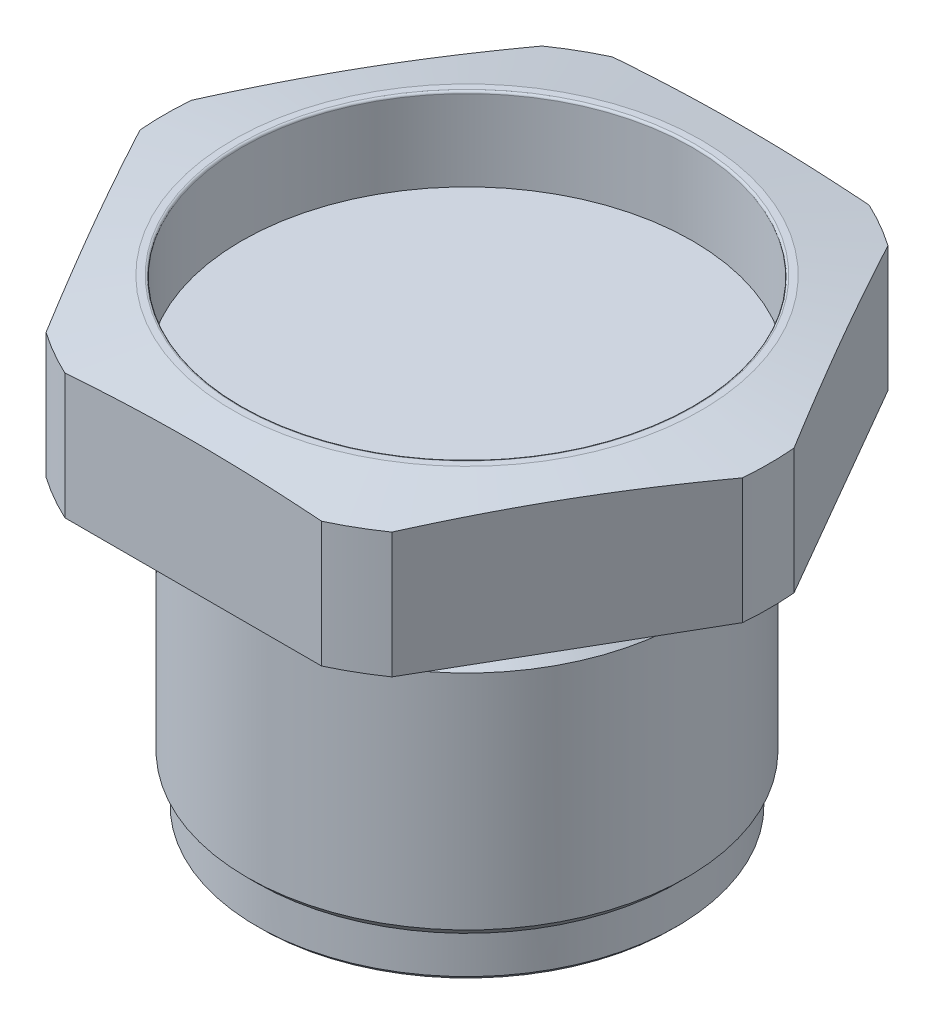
ISO-10303-21;
HEADER;
FILE_DESCRIPTION(('STEP AP214'),'2;1');
FILE_NAME('part.step','',(''),(''),'','','');
FILE_SCHEMA(('AUTOMOTIVE_DESIGN { 1 0 10303 214 1 1 1 1 }'));
ENDSEC;
DATA;
#1=APPLICATION_CONTEXT('core data for automotive mechanical design processes');
#2=APPLICATION_PROTOCOL_DEFINITION('international standard','automotive_design',2000,#1);
#3=PRODUCT_CONTEXT('',#1,'mechanical');
#4=PRODUCT('Part','Part','',(#3));
#5=PRODUCT_RELATED_PRODUCT_CATEGORY('part','',(#4));
#6=PRODUCT_DEFINITION_FORMATION('','',#4);
#7=PRODUCT_DEFINITION_CONTEXT('part definition',#1,'design');
#8=PRODUCT_DEFINITION('design','',#6,#7);
#9=PRODUCT_DEFINITION_SHAPE('','',#8);
#10=(LENGTH_UNIT() NAMED_UNIT(*) SI_UNIT(.MILLI.,.METRE.));
#11=(NAMED_UNIT(*) PLANE_ANGLE_UNIT() SI_UNIT($,.RADIAN.));
#12=(NAMED_UNIT(*) SI_UNIT($,.STERADIAN.) SOLID_ANGLE_UNIT());
#13=UNCERTAINTY_MEASURE_WITH_UNIT(LENGTH_MEASURE(1.E-05),#10,'distance_accuracy_value','');
#14=(GEOMETRIC_REPRESENTATION_CONTEXT(3) GLOBAL_UNCERTAINTY_ASSIGNED_CONTEXT((#13)) GLOBAL_UNIT_ASSIGNED_CONTEXT((#10,
#11,#12)) REPRESENTATION_CONTEXT('',''));
#15=CARTESIAN_POINT('',(0.,0.,0.));
#16=DIRECTION('',(0.,0.,1.));
#17=DIRECTION('',(1.,0.,0.));
#18=AXIS2_PLACEMENT_3D('',#15,#16,#17);
#19=CARTESIAN_POINT('',(24.257,-37.6428,0.));
#20=DIRECTION('',(0.,-1.,0.));
#21=DIRECTION('',(0.,0.,-1.));
#22=AXIS2_PLACEMENT_3D('',#19,#20,#21);
#23=PLANE('',#22);
#24=CARTESIAN_POINT('',(0.,-37.6428,0.));
#25=DIRECTION('',(0.,-1.,0.));
#26=DIRECTION('',(0.,0.,-1.));
#27=AXIS2_PLACEMENT_3D('',#24,#25,#26);
#28=CIRCLE('',#27,22.1334044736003);
#29=CARTESIAN_POINT('',(0.,-37.6428,-22.1334044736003));
#30=VERTEX_POINT('',#29);
#31=EDGE_CURVE('E12',#30,#30,#28,.T.);
#32=ORIENTED_EDGE('',*,*,#31,.F.);
#33=EDGE_LOOP('',(#32));
#34=FACE_BOUND('',#33,.T.);
#35=CARTESIAN_POINT('',(0.,-37.6428,0.));
#36=DIRECTION('',(0.,-1.,0.));
#37=DIRECTION('',(0.,0.,-1.));
#38=AXIS2_PLACEMENT_3D('',#35,#36,#37);
#39=CIRCLE('',#38,23.75700224);
#40=CARTESIAN_POINT('',(0.,-37.6428,-23.75700224));
#41=VERTEX_POINT('',#40);
#42=EDGE_CURVE('E184',#41,#41,#39,.T.);
#43=ORIENTED_EDGE('',*,*,#42,.T.);
#44=EDGE_LOOP('',(#43));
#45=FACE_BOUND('',#44,.T.);
#46=ADVANCED_FACE('F35',(#34,#45),#23,.T.);
#47=CARTESIAN_POINT('',(0.,-8.96894233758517,0.));
#48=DIRECTION('',(0.,-1.,0.));
#49=DIRECTION('',(0.,0.,-1.));
#50=AXIS2_PLACEMENT_3D('',#47,#48,#49);
#51=CYLINDRICAL_SURFACE('',#50,24.257);
#52=CARTESIAN_POINT('',(0.,-0.508,0.));
#53=DIRECTION('',(0.,-1.,0.));
#54=DIRECTION('',(0.,0.,-1.));
#55=AXIS2_PLACEMENT_3D('',#52,#53,#54);
#56=CIRCLE('',#55,24.257);
#57=CARTESIAN_POINT('',(0.,-0.508,-24.257));
#58=VERTEX_POINT('',#57);
#59=EDGE_CURVE('E201',#58,#58,#56,.T.);
#60=ORIENTED_EDGE('',*,*,#59,.T.);
#61=EDGE_LOOP('',(#60));
#62=FACE_BOUND('',#61,.T.);
#63=CARTESIAN_POINT('',(0.,-4.826,0.));
#64=DIRECTION('',(0.,-1.,0.));
#65=DIRECTION('',(0.,0.,-1.));
#66=AXIS2_PLACEMENT_3D('',#63,#64,#65);
#67=CIRCLE('',#66,24.257);
#68=CARTESIAN_POINT('',(0.,-4.826,-24.257));
#69=VERTEX_POINT('',#68);
#70=EDGE_CURVE('E198',#69,#69,#67,.T.);
#71=ORIENTED_EDGE('',*,*,#70,.F.);
#72=EDGE_LOOP('',(#71));
#73=FACE_BOUND('',#72,.T.);
#74=ADVANCED_FACE('F213',(#62,#73),#51,.T.);
#75=CARTESIAN_POINT('',(0.,14.4866013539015,0.));
#76=DIRECTION('',(0.,-1.,0.));
#77=DIRECTION('',(0.,0.,-1.));
#78=AXIS2_PLACEMENT_3D('',#75,#76,#77);
#79=CONICAL_SURFACE('',#78,34.925,1.39626340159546);
#80=CARTESIAN_POINT('',(0.,15.875,0.));
#81=DIRECTION('',(0.,-1.,0.));
#82=DIRECTION('',(0.,0.,-1.));
#83=AXIS2_PLACEMENT_3D('',#80,#81,#82);
#84=CIRCLE('',#83,27.051);
#85=CARTESIAN_POINT('',(0.,15.875,-27.051));
#86=VERTEX_POINT('',#85);
#87=EDGE_CURVE('E160',#86,#86,#84,.T.);
#88=ORIENTED_EDGE('',*,*,#87,.T.);
#89=EDGE_LOOP('',(#88));
#90=FACE_BOUND('',#89,.T.);
#91=CARTESIAN_POINT('',(0.,14.4866013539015,0.));
#92=DIRECTION('',(0.,-1.,0.));
#93=DIRECTION('',(0.,0.,-1.));
#94=AXIS2_PLACEMENT_3D('',#91,#92,#93);
#95=CIRCLE('',#94,34.925);
#96=CARTESIAN_POINT('',(-34.798161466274,14.4866013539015,2.97381633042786));
#97=VERTEX_POINT('',#96);
#98=CARTESIAN_POINT('',(-34.7981614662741,14.4866013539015,-2.97381633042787));
#99=VERTEX_POINT('',#98);
#100=EDGE_CURVE('E372',#97,#99,#95,.T.);
#101=ORIENTED_EDGE('',*,*,#100,.F.);
#102=CARTESIAN_POINT('',(-34.7994975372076,14.4864013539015,2.97150218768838));
#103=CARTESIAN_POINT('',(-34.490945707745,14.5325933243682,3.50592963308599));
#104=CARTESIAN_POINT('',(-34.1823063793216,14.5764325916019,4.04050863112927));
#105=CARTESIAN_POINT('',(-33.5648562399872,14.6590851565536,5.1099636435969));
#106=CARTESIAN_POINT('',(-33.2560454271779,14.6978983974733,5.64483966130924));
#107=CARTESIAN_POINT('',(-32.3293298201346,14.8063216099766,7.24995817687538));
#108=CARTESIAN_POINT('',(-31.7111834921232,14.8679087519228,8.32061902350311));
#109=CARTESIAN_POINT('',(-30.4753697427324,14.9673711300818,10.4611112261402));
#110=CARTESIAN_POINT('',(-29.8577030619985,15.0052829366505,11.5309412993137));
#111=CARTESIAN_POINT('',(-28.6221313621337,15.056013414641,13.6710142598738));
#112=CARTESIAN_POINT('',(-28.0042263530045,15.0688330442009,14.7412571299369));
#113=CARTESIAN_POINT('',(-26.7684163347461,15.0688330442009,16.8817428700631));
#114=CARTESIAN_POINT('',(-26.1505113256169,15.056013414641,17.9519857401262));
#115=CARTESIAN_POINT('',(-24.9149396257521,15.0052829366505,20.0920587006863));
#116=CARTESIAN_POINT('',(-24.2972729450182,14.9673711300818,21.1618887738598));
#117=CARTESIAN_POINT('',(-23.0614591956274,14.8679087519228,23.3023809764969));
#118=CARTESIAN_POINT('',(-22.4433128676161,14.8063216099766,24.3730418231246));
#119=CARTESIAN_POINT('',(-21.5165972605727,14.6978983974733,25.9781603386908));
#120=CARTESIAN_POINT('',(-21.2077864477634,14.6590851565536,26.5130363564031));
#121=CARTESIAN_POINT('',(-20.590336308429,14.5764325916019,27.5824913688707));
#122=CARTESIAN_POINT('',(-20.2816969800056,14.5325933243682,28.117070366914));
#123=CARTESIAN_POINT('',(-19.973145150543,14.4864013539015,28.6514978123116));
#124=B_SPLINE_CURVE_WITH_KNOTS('',3,(#102,#103,#104,#105,#106,#107,#108,#109,#110,#111,#112,
#113,#114,#115,#116,#117,#118,#119,#120,#121,#122,#123),.UNSPECIFIED.,.F.,.F.,(4,2,2,2,2,2,2,2,
2,2,4),(0.,1.85648195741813,3.71298489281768,7.42624125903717,11.1337476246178,14.8411124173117,
18.5484772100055,22.2559835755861,25.9692399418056,27.8257428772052,29.6822248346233),.UNSPECIFIED.);
#125=CARTESIAN_POINT('',(-19.9744812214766,14.4866013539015,28.6491836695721));
#126=VERTEX_POINT('',#125);
#127=EDGE_CURVE('E333',#97,#126,#124,.T.);
#128=ORIENTED_EDGE('',*,*,#127,.T.);
#129=CARTESIAN_POINT('',(-14.8236802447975,14.4866013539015,31.623));
#130=VERTEX_POINT('',#129);
#131=EDGE_CURVE('E178',#130,#126,#95,.T.);
#132=ORIENTED_EDGE('',*,*,#131,.F.);
#133=CARTESIAN_POINT('',(-48.1567000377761,10.4863639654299,31.623));
#134=CARTESIAN_POINT('',(-47.4393926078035,10.5920854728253,31.623));
#135=CARTESIAN_POINT('',(-46.7219832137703,10.6971147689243,31.623));
#136=CARTESIAN_POINT('',(-45.2869404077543,10.9056390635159,31.623));
#137=CARTESIAN_POINT('',(-44.569306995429,11.0091340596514,31.623));
#138=CARTESIAN_POINT('',(-42.4160180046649,11.3170960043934,31.623));
#139=CARTESIAN_POINT('',(-40.9799995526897,11.5190360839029,31.623));
#140=CARTESIAN_POINT('',(-38.1062127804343,11.9147802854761,31.623));
#141=CARTESIAN_POINT('',(-36.6684439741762,12.1085808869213,31.623));
#142=CARTESIAN_POINT('',(-33.7915811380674,12.4860790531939,31.623));
#143=CARTESIAN_POINT('',(-32.3524871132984,12.6697766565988,31.623));
#144=CARTESIAN_POINT('',(-29.4776046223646,13.0241287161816,31.623));
#145=CARTESIAN_POINT('',(-28.0418213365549,13.1948249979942,31.623));
#146=CARTESIAN_POINT('',(-25.168512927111,13.5209937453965,31.623));
#147=CARTESIAN_POINT('',(-23.7309878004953,13.6764661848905,31.623));
#148=CARTESIAN_POINT('',(-20.8541177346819,13.968739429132,31.623));
#149=CARTESIAN_POINT('',(-19.4147729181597,14.1055414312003,31.623));
#150=CARTESIAN_POINT('',(-16.5340924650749,14.3565373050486,31.623));
#151=CARTESIAN_POINT('',(-15.0927568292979,14.4707311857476,31.623));
#152=CARTESIAN_POINT('',(-12.2014034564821,14.6727749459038,31.623));
#153=CARTESIAN_POINT('',(-10.7513767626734,14.760498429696,31.623));
#154=CARTESIAN_POINT('',(-7.84976297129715,14.904850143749,31.623));
#155=CARTESIAN_POINT('',(-6.39817588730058,14.9614786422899,31.623));
#156=CARTESIAN_POINT('',(-3.49431685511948,15.0405951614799,31.623));
#157=CARTESIAN_POINT('',(-2.04204507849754,15.0630893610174,31.623));
#158=CARTESIAN_POINT('',(0.862616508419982,15.0726378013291,31.623));
#159=CARTESIAN_POINT('',(2.31500631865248,15.0596920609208,31.623));
#160=CARTESIAN_POINT('',(5.22133074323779,14.9990802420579,31.623));
#161=CARTESIAN_POINT('',(6.67526419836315,14.9513596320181,31.623));
#162=CARTESIAN_POINT('',(9.58170754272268,14.8237856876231,31.623));
#163=CARTESIAN_POINT('',(11.0342174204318,14.7439320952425,31.623));
#164=CARTESIAN_POINT('',(13.9377497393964,14.5559219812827,31.623));
#165=CARTESIAN_POINT('',(15.3887717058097,14.4477582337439,31.623));
#166=CARTESIAN_POINT('',(18.2888053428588,14.2074244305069,31.623));
#167=CARTESIAN_POINT('',(19.7378170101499,14.0752543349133,31.623));
#168=CARTESIAN_POINT('',(22.5560206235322,13.7986726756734,31.623));
#169=CARTESIAN_POINT('',(23.9253156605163,13.6553012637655,31.623));
#170=CARTESIAN_POINT('',(26.6622944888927,13.3538554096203,31.623));
#171=CARTESIAN_POINT('',(28.029978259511,13.1957807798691,31.623));
#172=CARTESIAN_POINT('',(30.7639552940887,12.8675564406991,31.623));
#173=CARTESIAN_POINT('',(32.1302484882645,12.6974061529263,31.623));
#174=CARTESIAN_POINT('',(34.861555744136,12.3472108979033,31.623));
#175=CARTESIAN_POINT('',(36.2265698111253,12.167165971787,31.623));
#176=CARTESIAN_POINT('',(38.9557031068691,11.7989174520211,31.623));
#177=CARTESIAN_POINT('',(40.3198221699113,11.6107126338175,31.623));
#178=CARTESIAN_POINT('',(43.0471163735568,11.2275913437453,31.623));
#179=CARTESIAN_POINT('',(44.4102915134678,11.0326748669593,31.623));
#180=CARTESIAN_POINT('',(47.1357929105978,10.6372788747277,31.623));
#181=CARTESIAN_POINT('',(48.4981191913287,10.4367995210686,31.623));
#182=CARTESIAN_POINT('',(51.222077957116,10.0311913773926,31.623));
#183=CARTESIAN_POINT('',(52.5837104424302,9.82606258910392,31.623));
#184=CARTESIAN_POINT('',(55.3005625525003,9.4127836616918,31.623));
#185=CARTESIAN_POINT('',(56.6557847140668,9.20465018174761,31.623));
#186=CARTESIAN_POINT('',(59.3657211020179,8.78510037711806,31.623));
#187=CARTESIAN_POINT('',(60.720435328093,8.57368405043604,31.623));
#188=CARTESIAN_POINT('',(64.7839427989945,7.93525909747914,31.623));
#189=CARTESIAN_POINT('',(67.492080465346,7.50407761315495,31.623));
#190=CARTESIAN_POINT('',(72.9053414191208,6.6337902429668,31.623));
#191=CARTESIAN_POINT('',(75.6104655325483,6.19468948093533,31.623));
#192=CARTESIAN_POINT('',(79.6673673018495,5.53137848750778,31.623));
#193=CARTESIAN_POINT('',(81.0195267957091,5.30949990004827,31.623));
#194=CARTESIAN_POINT('',(83.7236190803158,4.86436973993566,31.623));
#195=CARTESIAN_POINT('',(85.0755518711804,4.6411181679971,31.623));
#196=CARTESIAN_POINT('',(86.4273859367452,4.41727067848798,31.623));
#197=B_SPLINE_CURVE_WITH_KNOTS('',3,(#133,#134,#135,#136,#137,#138,#139,#140,#141,#142,#143,
#144,#145,#146,#147,#148,#149,#150,#151,#152,#153,#154,#155,#156,#157,#158,#159,#160,#161,#162,
#163,#164,#165,#166,#167,#168,#169,#170,#171,#172,#173,#174,#175,#176,#177,#178,#179,#180,#181,
#182,#183,#184,#185,#186,#187,#188,#189,#190,#191,#192,#193,#194,#195,#196),.UNSPECIFIED.,.F.,
.F.,(4,2,2,2,2,2,2,2,2,2,2,2,2,2,2,2,2,2,2,2,2,2,2,2,2,2,2,2,2,2,2,4),(0.,2.17516898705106,
4.35034131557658,8.70076445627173,13.0530503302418,17.4053195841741,21.7429377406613,
26.0805633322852,30.4179106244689,34.7552562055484,39.1129962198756,43.4706986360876,
47.8276121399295,52.184523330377,56.5482814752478,60.9120746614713,65.276982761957,
69.6418981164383,73.7721456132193,77.9024457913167,82.032943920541,86.1634248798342,
90.294527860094,94.4256338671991,98.5566198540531,102.687604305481,106.800933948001,
110.914266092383,119.140992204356,127.362574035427,131.473301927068,135.584027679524),.UNSPECIFIED.);
#198=CARTESIAN_POINT('',(14.8236802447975,14.4866013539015,31.623));
#199=VERTEX_POINT('',#198);
#200=EDGE_CURVE('E338',#130,#199,#197,.T.);
#201=ORIENTED_EDGE('',*,*,#200,.T.);
#202=CARTESIAN_POINT('',(19.9744812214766,14.4866013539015,28.6491836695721));
#203=VERTEX_POINT('',#202);
#204=EDGE_CURVE('E375',#203,#199,#95,.T.);
#205=ORIENTED_EDGE('',*,*,#204,.F.);
#206=CARTESIAN_POINT('',(19.973145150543,14.4864013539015,28.6514978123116));
#207=CARTESIAN_POINT('',(20.2816969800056,14.5325933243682,28.117070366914));
#208=CARTESIAN_POINT('',(20.590336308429,14.5764325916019,27.5824913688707));
#209=CARTESIAN_POINT('',(21.2077864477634,14.6590851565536,26.5130363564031));
#210=CARTESIAN_POINT('',(21.5165972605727,14.6978983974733,25.9781603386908));
#211=CARTESIAN_POINT('',(22.4433128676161,14.8063216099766,24.3730418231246));
#212=CARTESIAN_POINT('',(23.0614591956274,14.8679087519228,23.3023809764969));
#213=CARTESIAN_POINT('',(24.2972729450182,14.9673711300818,21.1618887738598));
#214=CARTESIAN_POINT('',(24.9149396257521,15.0052829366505,20.0920587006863));
#215=CARTESIAN_POINT('',(26.1505113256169,15.056013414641,17.9519857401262));
#216=CARTESIAN_POINT('',(26.7684163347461,15.0688330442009,16.8817428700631));
#217=CARTESIAN_POINT('',(28.0042263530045,15.0688330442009,14.7412571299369));
#218=CARTESIAN_POINT('',(28.6221313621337,15.056013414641,13.6710142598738));
#219=CARTESIAN_POINT('',(29.8577030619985,15.0052829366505,11.5309412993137));
#220=CARTESIAN_POINT('',(30.4753697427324,14.9673711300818,10.4611112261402));
#221=CARTESIAN_POINT('',(31.7111834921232,14.8679087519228,8.32061902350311));
#222=CARTESIAN_POINT('',(32.3293298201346,14.8063216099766,7.24995817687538));
#223=CARTESIAN_POINT('',(33.2560454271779,14.6978983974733,5.64483966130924));
#224=CARTESIAN_POINT('',(33.5648562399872,14.6590851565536,5.10996364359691));
#225=CARTESIAN_POINT('',(34.1823063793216,14.5764325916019,4.04050863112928));
#226=CARTESIAN_POINT('',(34.490945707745,14.5325933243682,3.50592963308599));
#227=CARTESIAN_POINT('',(34.7994975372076,14.4864013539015,2.97150218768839));
#228=B_SPLINE_CURVE_WITH_KNOTS('',3,(#206,#207,#208,#209,#210,#211,#212,#213,#214,#215,#216,
#217,#218,#219,#220,#221,#222,#223,#224,#225,#226,#227),.UNSPECIFIED.,.F.,.F.,(4,2,2,2,2,2,2,2,
2,2,4),(0.,1.85648195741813,3.71298489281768,7.42624125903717,11.1337476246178,14.8411124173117,
18.5484772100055,22.2559835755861,25.9692399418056,27.8257428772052,29.6822248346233),.UNSPECIFIED.);
#229=CARTESIAN_POINT('',(34.7981614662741,14.4866013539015,2.97381633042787));
#230=VERTEX_POINT('',#229);
#231=EDGE_CURVE('E344',#203,#230,#228,.T.);
#232=ORIENTED_EDGE('',*,*,#231,.T.);
#233=CARTESIAN_POINT('',(34.798161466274,14.4866013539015,-2.97381633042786));
#234=VERTEX_POINT('',#233);
#235=EDGE_CURVE('E150',#234,#230,#95,.T.);
#236=ORIENTED_EDGE('',*,*,#235,.F.);
#237=CARTESIAN_POINT('',(34.7994975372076,14.4864013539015,-2.97150218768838));
#238=CARTESIAN_POINT('',(34.490945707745,14.5325933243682,-3.50592963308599));
#239=CARTESIAN_POINT('',(34.1823063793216,14.5764325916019,-4.04050863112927));
#240=CARTESIAN_POINT('',(33.5648562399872,14.6590851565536,-5.1099636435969));
#241=CARTESIAN_POINT('',(33.2560454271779,14.6978983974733,-5.64483966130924));
#242=CARTESIAN_POINT('',(32.3293298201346,14.8063216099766,-7.24995817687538));
#243=CARTESIAN_POINT('',(31.7111834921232,14.8679087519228,-8.32061902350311));
#244=CARTESIAN_POINT('',(30.4753697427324,14.9673711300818,-10.4611112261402));
#245=CARTESIAN_POINT('',(29.8577030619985,15.0052829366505,-11.5309412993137));
#246=CARTESIAN_POINT('',(28.6221313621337,15.056013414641,-13.6710142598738));
#247=CARTESIAN_POINT('',(28.0042263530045,15.0688330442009,-14.7412571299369));
#248=CARTESIAN_POINT('',(26.7684163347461,15.0688330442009,-16.8817428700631));
#249=CARTESIAN_POINT('',(26.1505113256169,15.056013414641,-17.9519857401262));
#250=CARTESIAN_POINT('',(24.9149396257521,15.0052829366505,-20.0920587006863));
#251=CARTESIAN_POINT('',(24.2972729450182,14.9673711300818,-21.1618887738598));
#252=CARTESIAN_POINT('',(23.0614591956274,14.8679087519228,-23.3023809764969));
#253=CARTESIAN_POINT('',(22.4433128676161,14.8063216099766,-24.3730418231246));
#254=CARTESIAN_POINT('',(21.5165972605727,14.6978983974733,-25.9781603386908));
#255=CARTESIAN_POINT('',(21.2077864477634,14.6590851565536,-26.5130363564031));
#256=CARTESIAN_POINT('',(20.590336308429,14.5764325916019,-27.5824913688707));
#257=CARTESIAN_POINT('',(20.2816969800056,14.5325933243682,-28.117070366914));
#258=CARTESIAN_POINT('',(19.973145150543,14.4864013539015,-28.6514978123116));
#259=B_SPLINE_CURVE_WITH_KNOTS('',3,(#237,#238,#239,#240,#241,#242,#243,#244,#245,#246,#247,
#248,#249,#250,#251,#252,#253,#254,#255,#256,#257,#258),.UNSPECIFIED.,.F.,.F.,(4,2,2,2,2,2,2,2,
2,2,4),(0.,1.85648195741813,3.71298489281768,7.42624125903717,11.1337476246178,14.8411124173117,
18.5484772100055,22.2559835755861,25.9692399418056,27.8257428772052,29.6822248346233),.UNSPECIFIED.);
#260=CARTESIAN_POINT('',(19.9744812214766,14.4866013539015,-28.6491836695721));
#261=VERTEX_POINT('',#260);
#262=EDGE_CURVE('E360',#234,#261,#259,.T.);
#263=ORIENTED_EDGE('',*,*,#262,.T.);
#264=CARTESIAN_POINT('',(14.8236802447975,14.4866013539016,-31.623));
#265=VERTEX_POINT('',#264);
#266=EDGE_CURVE('E145',#265,#261,#95,.T.);
#267=ORIENTED_EDGE('',*,*,#266,.F.);
#268=CARTESIAN_POINT('',(-48.1567000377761,10.4863639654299,-31.623));
#269=CARTESIAN_POINT('',(-47.4393926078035,10.5920854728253,-31.623));
#270=CARTESIAN_POINT('',(-46.7219832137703,10.6971147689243,-31.623));
#271=CARTESIAN_POINT('',(-45.2869404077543,10.9056390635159,-31.623));
#272=CARTESIAN_POINT('',(-44.569306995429,11.0091340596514,-31.623));
#273=CARTESIAN_POINT('',(-42.4160180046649,11.3170960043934,-31.623));
#274=CARTESIAN_POINT('',(-40.9799995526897,11.5190360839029,-31.623));
#275=CARTESIAN_POINT('',(-38.1062127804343,11.9147802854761,-31.623));
#276=CARTESIAN_POINT('',(-36.6684439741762,12.1085808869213,-31.623));
#277=CARTESIAN_POINT('',(-33.7915811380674,12.4860790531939,-31.623));
#278=CARTESIAN_POINT('',(-32.3524871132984,12.6697766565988,-31.623));
#279=CARTESIAN_POINT('',(-29.4776046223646,13.0241287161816,-31.623));
#280=CARTESIAN_POINT('',(-28.0418213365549,13.1948249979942,-31.623));
#281=CARTESIAN_POINT('',(-25.168512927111,13.5209937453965,-31.623));
#282=CARTESIAN_POINT('',(-23.7309878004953,13.6764661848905,-31.623));
#283=CARTESIAN_POINT('',(-20.8541177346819,13.968739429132,-31.623));
#284=CARTESIAN_POINT('',(-19.4147729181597,14.1055414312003,-31.623));
#285=CARTESIAN_POINT('',(-16.5340924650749,14.3565373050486,-31.623));
#286=CARTESIAN_POINT('',(-15.0927568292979,14.4707311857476,-31.623));
#287=CARTESIAN_POINT('',(-12.2014034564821,14.6727749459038,-31.623));
#288=CARTESIAN_POINT('',(-10.7513767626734,14.760498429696,-31.623));
#289=CARTESIAN_POINT('',(-7.84976297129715,14.904850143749,-31.623));
#290=CARTESIAN_POINT('',(-6.39817588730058,14.9614786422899,-31.623));
#291=CARTESIAN_POINT('',(-3.49431685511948,15.0405951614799,-31.623));
#292=CARTESIAN_POINT('',(-2.04204507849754,15.0630893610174,-31.623));
#293=CARTESIAN_POINT('',(0.862616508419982,15.0726378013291,-31.623));
#294=CARTESIAN_POINT('',(2.31500631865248,15.0596920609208,-31.623));
#295=CARTESIAN_POINT('',(5.22133074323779,14.9990802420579,-31.623));
#296=CARTESIAN_POINT('',(6.67526419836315,14.9513596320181,-31.623));
#297=CARTESIAN_POINT('',(9.58170754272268,14.8237856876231,-31.623));
#298=CARTESIAN_POINT('',(11.0342174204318,14.7439320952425,-31.623));
#299=CARTESIAN_POINT('',(13.9377497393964,14.5559219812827,-31.623));
#300=CARTESIAN_POINT('',(15.3887717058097,14.4477582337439,-31.623));
#301=CARTESIAN_POINT('',(18.2888053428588,14.2074244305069,-31.623));
#302=CARTESIAN_POINT('',(19.7378170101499,14.0752543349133,-31.623));
#303=CARTESIAN_POINT('',(22.5560206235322,13.7986726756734,-31.623));
#304=CARTESIAN_POINT('',(23.9253156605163,13.6553012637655,-31.623));
#305=CARTESIAN_POINT('',(26.6622944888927,13.3538554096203,-31.623));
#306=CARTESIAN_POINT('',(28.029978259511,13.1957807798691,-31.623));
#307=CARTESIAN_POINT('',(30.7639552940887,12.8675564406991,-31.623));
#308=CARTESIAN_POINT('',(32.1302484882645,12.6974061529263,-31.623));
#309=CARTESIAN_POINT('',(34.861555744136,12.3472108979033,-31.623));
#310=CARTESIAN_POINT('',(36.2265698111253,12.167165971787,-31.623));
#311=CARTESIAN_POINT('',(38.9557031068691,11.7989174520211,-31.623));
#312=CARTESIAN_POINT('',(40.3198221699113,11.6107126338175,-31.623));
#313=CARTESIAN_POINT('',(43.0471163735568,11.2275913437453,-31.623));
#314=CARTESIAN_POINT('',(44.4102915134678,11.0326748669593,-31.623));
#315=CARTESIAN_POINT('',(47.1357929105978,10.6372788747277,-31.623));
#316=CARTESIAN_POINT('',(48.4981191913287,10.4367995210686,-31.623));
#317=CARTESIAN_POINT('',(51.222077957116,10.0311913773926,-31.623));
#318=CARTESIAN_POINT('',(52.5837104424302,9.82606258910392,-31.623));
#319=CARTESIAN_POINT('',(55.3005625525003,9.4127836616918,-31.623));
#320=CARTESIAN_POINT('',(56.6557847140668,9.20465018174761,-31.623));
#321=CARTESIAN_POINT('',(59.3657211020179,8.78510037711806,-31.623));
#322=CARTESIAN_POINT('',(60.720435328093,8.57368405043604,-31.623));
#323=CARTESIAN_POINT('',(64.7839427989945,7.93525909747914,-31.623));
#324=CARTESIAN_POINT('',(67.492080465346,7.50407761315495,-31.623));
#325=CARTESIAN_POINT('',(72.9053414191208,6.6337902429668,-31.623));
#326=CARTESIAN_POINT('',(75.6104655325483,6.19468948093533,-31.623));
#327=CARTESIAN_POINT('',(79.6673673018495,5.53137848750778,-31.623));
#328=CARTESIAN_POINT('',(81.0195267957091,5.30949990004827,-31.623));
#329=CARTESIAN_POINT('',(83.7236190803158,4.86436973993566,-31.623));
#330=CARTESIAN_POINT('',(85.0755518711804,4.6411181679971,-31.623));
#331=CARTESIAN_POINT('',(86.4273859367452,4.41727067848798,-31.623));
#332=B_SPLINE_CURVE_WITH_KNOTS('',3,(#268,#269,#270,#271,#272,#273,#274,#275,#276,#277,#278,
#279,#280,#281,#282,#283,#284,#285,#286,#287,#288,#289,#290,#291,#292,#293,#294,#295,#296,#297,
#298,#299,#300,#301,#302,#303,#304,#305,#306,#307,#308,#309,#310,#311,#312,#313,#314,#315,#316,
#317,#318,#319,#320,#321,#322,#323,#324,#325,#326,#327,#328,#329,#330,#331),.UNSPECIFIED.,.F.,
.F.,(4,2,2,2,2,2,2,2,2,2,2,2,2,2,2,2,2,2,2,2,2,2,2,2,2,2,2,2,2,2,2,4),(0.,2.17516898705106,
4.35034131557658,8.70076445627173,13.0530503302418,17.4053195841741,21.7429377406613,
26.0805633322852,30.4179106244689,34.7552562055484,39.1129962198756,43.4706986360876,
47.8276121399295,52.184523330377,56.5482814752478,60.9120746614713,65.276982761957,
69.6418981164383,73.7721456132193,77.9024457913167,82.032943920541,86.1634248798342,
90.294527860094,94.4256338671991,98.5566198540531,102.687604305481,106.800933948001,
110.914266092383,119.140992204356,127.362574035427,131.473301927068,135.584027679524),.UNSPECIFIED.);
#333=CARTESIAN_POINT('',(-14.8236802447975,14.4866013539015,-31.623));
#334=VERTEX_POINT('',#333);
#335=EDGE_CURVE('E313',#265,#334,#332,.F.);
#336=ORIENTED_EDGE('',*,*,#335,.T.);
#337=CARTESIAN_POINT('',(-19.9744812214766,14.4866013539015,-28.6491836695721));
#338=VERTEX_POINT('',#337);
#339=EDGE_CURVE('E152',#338,#334,#95,.T.);
#340=ORIENTED_EDGE('',*,*,#339,.F.);
#341=CARTESIAN_POINT('',(-19.973145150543,14.4864013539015,-28.6514978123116));
#342=CARTESIAN_POINT('',(-20.2816969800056,14.5325933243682,-28.117070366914));
#343=CARTESIAN_POINT('',(-20.590336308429,14.5764325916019,-27.5824913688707));
#344=CARTESIAN_POINT('',(-21.2077864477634,14.6590851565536,-26.5130363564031));
#345=CARTESIAN_POINT('',(-21.5165972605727,14.6978983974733,-25.9781603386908));
#346=CARTESIAN_POINT('',(-22.4433128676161,14.8063216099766,-24.3730418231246));
#347=CARTESIAN_POINT('',(-23.0614591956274,14.8679087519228,-23.3023809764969));
#348=CARTESIAN_POINT('',(-24.2972729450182,14.9673711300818,-21.1618887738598));
#349=CARTESIAN_POINT('',(-24.9149396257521,15.0052829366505,-20.0920587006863));
#350=CARTESIAN_POINT('',(-26.1505113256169,15.056013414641,-17.9519857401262));
#351=CARTESIAN_POINT('',(-26.7684163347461,15.0688330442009,-16.8817428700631));
#352=CARTESIAN_POINT('',(-28.0042263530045,15.0688330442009,-14.7412571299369));
#353=CARTESIAN_POINT('',(-28.6221313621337,15.056013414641,-13.6710142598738));
#354=CARTESIAN_POINT('',(-29.8577030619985,15.0052829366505,-11.5309412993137));
#355=CARTESIAN_POINT('',(-30.4753697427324,14.9673711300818,-10.4611112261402));
#356=CARTESIAN_POINT('',(-31.7111834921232,14.8679087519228,-8.32061902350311));
#357=CARTESIAN_POINT('',(-32.3293298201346,14.8063216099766,-7.24995817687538));
#358=CARTESIAN_POINT('',(-33.2560454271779,14.6978983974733,-5.64483966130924));
#359=CARTESIAN_POINT('',(-33.5648562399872,14.6590851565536,-5.10996364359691));
#360=CARTESIAN_POINT('',(-34.1823063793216,14.5764325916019,-4.04050863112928));
#361=CARTESIAN_POINT('',(-34.490945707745,14.5325933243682,-3.50592963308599));
#362=CARTESIAN_POINT('',(-34.7994975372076,14.4864013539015,-2.97150218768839));
#363=B_SPLINE_CURVE_WITH_KNOTS('',3,(#341,#342,#343,#344,#345,#346,#347,#348,#349,#350,#351,
#352,#353,#354,#355,#356,#357,#358,#359,#360,#361,#362),.UNSPECIFIED.,.F.,.F.,(4,2,2,2,2,2,2,2,
2,2,4),(0.,1.85648195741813,3.71298489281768,7.42624125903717,11.1337476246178,14.8411124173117,
18.5484772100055,22.2559835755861,25.9692399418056,27.8257428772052,29.6822248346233),.UNSPECIFIED.);
#364=EDGE_CURVE('E125',#338,#99,#363,.T.);
#365=ORIENTED_EDGE('',*,*,#364,.T.);
#366=EDGE_LOOP('',(#101,#128,#132,#201,#205,#232,#236,#263,#267,#336,#340,#365));
#367=FACE_BOUND('',#366,.T.);
#368=ADVANCED_FACE('F216',(#90,#367),#79,.T.);
#369=CARTESIAN_POINT('',(34.925,0.,0.));
#370=DIRECTION('',(0.,-1.,0.));
#371=DIRECTION('',(0.,0.,-1.));
#372=AXIS2_PLACEMENT_3D('',#369,#370,#371);
#373=PLANE('',#372);
#374=CARTESIAN_POINT('',(0.,0.,0.));
#375=DIRECTION('',(0.,-1.,0.));
#376=DIRECTION('',(0.,0.,-1.));
#377=AXIS2_PLACEMENT_3D('',#374,#375,#376);
#378=CIRCLE('',#377,24.765);
#379=CARTESIAN_POINT('',(0.,0.,-24.765));
#380=VERTEX_POINT('',#379);
#381=EDGE_CURVE('E43',#380,#380,#378,.F.);
#382=ORIENTED_EDGE('',*,*,#381,.T.);
#383=EDGE_LOOP('',(#382));
#384=FACE_BOUND('',#383,.T.);
#385=CARTESIAN_POINT('',(0.,0.,0.));
#386=DIRECTION('',(0.,-1.,0.));
#387=DIRECTION('',(0.,0.,-1.));
#388=AXIS2_PLACEMENT_3D('',#385,#386,#387);
#389=CIRCLE('',#388,34.925);
#390=CARTESIAN_POINT('',(-14.8236802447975,0.,31.623));
#391=VERTEX_POINT('',#390);
#392=CARTESIAN_POINT('',(-19.9744812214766,0.,28.6491836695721));
#393=VERTEX_POINT('',#392);
#394=EDGE_CURVE('E148',#391,#393,#389,.T.);
#395=ORIENTED_EDGE('',*,*,#394,.T.);
#396=DIRECTION('',(-0.5,0.,-0.866025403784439));
#397=VECTOR('',#396,1.);
#398=CARTESIAN_POINT('',(-36.5150951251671,0.,0.));
#399=LINE('',#398,#397);
#400=CARTESIAN_POINT('',(-34.798161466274,0.,2.97381633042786));
#401=VERTEX_POINT('',#400);
#402=EDGE_CURVE('E142',#393,#401,#399,.T.);
#403=ORIENTED_EDGE('',*,*,#402,.T.);
#404=CARTESIAN_POINT('',(-34.7981614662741,0.,-2.97381633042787));
#405=VERTEX_POINT('',#404);
#406=EDGE_CURVE('E141',#401,#405,#389,.T.);
#407=ORIENTED_EDGE('',*,*,#406,.T.);
#408=DIRECTION('',(0.5,0.,-0.866025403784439));
#409=VECTOR('',#408,1.);
#410=CARTESIAN_POINT('',(-18.2575475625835,0.,-31.623));
#411=LINE('',#410,#409);
#412=CARTESIAN_POINT('',(-19.9744812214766,0.,-28.6491836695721));
#413=VERTEX_POINT('',#412);
#414=EDGE_CURVE('E58',#405,#413,#411,.T.);
#415=ORIENTED_EDGE('',*,*,#414,.T.);
#416=CARTESIAN_POINT('',(-14.8236802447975,0.,-31.623));
#417=VERTEX_POINT('',#416);
#418=EDGE_CURVE('E138',#413,#417,#389,.T.);
#419=ORIENTED_EDGE('',*,*,#418,.T.);
#420=DIRECTION('',(1.,0.,0.));
#421=VECTOR('',#420,1.);
#422=CARTESIAN_POINT('',(18.2575475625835,0.,-31.623));
#423=LINE('',#422,#421);
#424=CARTESIAN_POINT('',(14.8236802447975,0.,-31.623));
#425=VERTEX_POINT('',#424);
#426=EDGE_CURVE('E50',#417,#425,#423,.T.);
#427=ORIENTED_EDGE('',*,*,#426,.T.);
#428=CARTESIAN_POINT('',(19.9744812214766,0.,-28.6491836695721));
#429=VERTEX_POINT('',#428);
#430=EDGE_CURVE('E147',#425,#429,#389,.T.);
#431=ORIENTED_EDGE('',*,*,#430,.T.);
#432=DIRECTION('',(0.5,0.,0.866025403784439));
#433=VECTOR('',#432,1.);
#434=CARTESIAN_POINT('',(36.5150951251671,0.,0.));
#435=LINE('',#434,#433);
#436=CARTESIAN_POINT('',(34.798161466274,0.,-2.97381633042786));
#437=VERTEX_POINT('',#436);
#438=EDGE_CURVE('E302',#429,#437,#435,.T.);
#439=ORIENTED_EDGE('',*,*,#438,.T.);
#440=CARTESIAN_POINT('',(34.7981614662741,0.,2.97381633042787));
#441=VERTEX_POINT('',#440);
#442=EDGE_CURVE('E156',#437,#441,#389,.T.);
#443=ORIENTED_EDGE('',*,*,#442,.T.);
#444=DIRECTION('',(-0.5,0.,0.866025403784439));
#445=VECTOR('',#444,1.);
#446=CARTESIAN_POINT('',(18.2575475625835,0.,31.623));
#447=LINE('',#446,#445);
#448=CARTESIAN_POINT('',(19.9744812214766,0.,28.6491836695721));
#449=VERTEX_POINT('',#448);
#450=EDGE_CURVE('E304',#441,#449,#447,.T.);
#451=ORIENTED_EDGE('',*,*,#450,.T.);
#452=CARTESIAN_POINT('',(14.8236802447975,0.,31.623));
#453=VERTEX_POINT('',#452);
#454=EDGE_CURVE('E162',#449,#453,#389,.T.);
#455=ORIENTED_EDGE('',*,*,#454,.T.);
#456=DIRECTION('',(-1.,0.,0.));
#457=VECTOR('',#456,1.);
#458=CARTESIAN_POINT('',(-18.2575475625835,0.,31.623));
#459=LINE('',#458,#457);
#460=EDGE_CURVE('E169',#453,#391,#459,.T.);
#461=ORIENTED_EDGE('',*,*,#460,.T.);
#462=EDGE_LOOP('',(#395,#403,#407,#415,#419,#427,#431,#439,#443,#451,#455,#461));
#463=FACE_BOUND('',#462,.T.);
#464=ADVANCED_FACE('F137',(#384,#463),#373,.T.);
#465=CARTESIAN_POINT('',(0.,-8.96894233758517,0.));
#466=DIRECTION('',(0.,-1.,0.));
#467=DIRECTION('',(0.,0.,-1.));
#468=AXIS2_PLACEMENT_3D('',#465,#466,#467);
#469=CYLINDRICAL_SURFACE('',#468,34.925);
#470=ORIENTED_EDGE('',*,*,#406,.F.);
#471=DIRECTION('',(0.,-1.,0.));
#472=VECTOR('',#471,1.);
#473=CARTESIAN_POINT('',(-34.7981614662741,-8.96894233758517,2.97381633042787));
#474=LINE('',#473,#472);
#475=EDGE_CURVE('E181',#401,#97,#474,.F.);
#476=ORIENTED_EDGE('',*,*,#475,.T.);
#477=ORIENTED_EDGE('',*,*,#100,.T.);
#478=DIRECTION('',(0.,-1.,0.));
#479=VECTOR('',#478,1.);
#480=CARTESIAN_POINT('',(-34.7981614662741,-8.96894233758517,-2.97381633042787));
#481=LINE('',#480,#479);
#482=EDGE_CURVE('E131',#99,#405,#481,.T.);
#483=ORIENTED_EDGE('',*,*,#482,.T.);
#484=EDGE_LOOP('',(#470,#476,#477,#483));
#485=FACE_BOUND('',#484,.T.);
#486=ADVANCED_FACE('F330',(#485),#469,.T.);
#487=ORIENTED_EDGE('',*,*,#131,.T.);
#488=DIRECTION('',(0.,-1.,0.));
#489=VECTOR('',#488,1.);
#490=CARTESIAN_POINT('',(-19.9744812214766,-8.96894233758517,28.6491836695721));
#491=LINE('',#490,#489);
#492=EDGE_CURVE('E177',#126,#393,#491,.T.);
#493=ORIENTED_EDGE('',*,*,#492,.T.);
#494=ORIENTED_EDGE('',*,*,#394,.F.);
#495=DIRECTION('',(0.,-1.,0.));
#496=VECTOR('',#495,1.);
#497=CARTESIAN_POINT('',(-14.8236802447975,-8.96894233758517,31.623));
#498=LINE('',#497,#496);
#499=EDGE_CURVE('E175',#391,#130,#498,.F.);
#500=ORIENTED_EDGE('',*,*,#499,.T.);
#501=EDGE_LOOP('',(#487,#493,#494,#500));
#502=FACE_BOUND('',#501,.T.);
#503=ADVANCED_FACE('F174',(#502),#469,.T.);
#504=ORIENTED_EDGE('',*,*,#204,.T.);
#505=DIRECTION('',(0.,-1.,0.));
#506=VECTOR('',#505,1.);
#507=CARTESIAN_POINT('',(14.8236802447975,-8.96894233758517,31.623));
#508=LINE('',#507,#506);
#509=EDGE_CURVE('E186',#199,#453,#508,.T.);
#510=ORIENTED_EDGE('',*,*,#509,.T.);
#511=ORIENTED_EDGE('',*,*,#454,.F.);
#512=DIRECTION('',(0.,-1.,0.));
#513=VECTOR('',#512,1.);
#514=CARTESIAN_POINT('',(19.9744812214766,-8.96894233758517,28.6491836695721));
#515=LINE('',#514,#513);
#516=EDGE_CURVE('E388',#449,#203,#515,.F.);
#517=ORIENTED_EDGE('',*,*,#516,.T.);
#518=EDGE_LOOP('',(#504,#510,#511,#517));
#519=FACE_BOUND('',#518,.T.);
#520=ADVANCED_FACE('F389',(#519),#469,.T.);
#521=ORIENTED_EDGE('',*,*,#235,.T.);
#522=DIRECTION('',(0.,-1.,0.));
#523=VECTOR('',#522,1.);
#524=CARTESIAN_POINT('',(34.7981614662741,-8.96894233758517,2.97381633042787));
#525=LINE('',#524,#523);
#526=EDGE_CURVE('E386',#230,#441,#525,.T.);
#527=ORIENTED_EDGE('',*,*,#526,.T.);
#528=ORIENTED_EDGE('',*,*,#442,.F.);
#529=DIRECTION('',(0.,-1.,0.));
#530=VECTOR('',#529,1.);
#531=CARTESIAN_POINT('',(34.7981614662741,-8.96894233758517,-2.97381633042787));
#532=LINE('',#531,#530);
#533=EDGE_CURVE('E387',#437,#234,#532,.F.);
#534=ORIENTED_EDGE('',*,*,#533,.T.);
#535=EDGE_LOOP('',(#521,#527,#528,#534));
#536=FACE_BOUND('',#535,.T.);
#537=ADVANCED_FACE('F385',(#536),#469,.T.);
#538=ORIENTED_EDGE('',*,*,#266,.T.);
#539=DIRECTION('',(0.,-1.,0.));
#540=VECTOR('',#539,1.);
#541=CARTESIAN_POINT('',(19.9744812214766,-8.96894233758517,-28.6491836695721));
#542=LINE('',#541,#540);
#543=EDGE_CURVE('E394',#261,#429,#542,.T.);
#544=ORIENTED_EDGE('',*,*,#543,.T.);
#545=ORIENTED_EDGE('',*,*,#430,.F.);
#546=DIRECTION('',(0.,-1.,0.));
#547=VECTOR('',#546,1.);
#548=CARTESIAN_POINT('',(14.8236802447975,-8.96894233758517,-31.623));
#549=LINE('',#548,#547);
#550=EDGE_CURVE('E397',#425,#265,#549,.F.);
#551=ORIENTED_EDGE('',*,*,#550,.T.);
#552=EDGE_LOOP('',(#538,#544,#545,#551));
#553=FACE_BOUND('',#552,.T.);
#554=ADVANCED_FACE('F422',(#553),#469,.T.);
#555=ORIENTED_EDGE('',*,*,#339,.T.);
#556=DIRECTION('',(0.,-1.,0.));
#557=VECTOR('',#556,1.);
#558=CARTESIAN_POINT('',(-14.8236802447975,-8.96894233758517,-31.623));
#559=LINE('',#558,#557);
#560=EDGE_CURVE('E130',#334,#417,#559,.T.);
#561=ORIENTED_EDGE('',*,*,#560,.T.);
#562=ORIENTED_EDGE('',*,*,#418,.F.);
#563=DIRECTION('',(0.,-1.,0.));
#564=VECTOR('',#563,1.);
#565=CARTESIAN_POINT('',(-19.9744812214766,-8.96894233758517,-28.6491836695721));
#566=LINE('',#565,#564);
#567=EDGE_CURVE('E122',#413,#338,#566,.F.);
#568=ORIENTED_EDGE('',*,*,#567,.T.);
#569=EDGE_LOOP('',(#555,#561,#562,#568));
#570=FACE_BOUND('',#569,.T.);
#571=ADVANCED_FACE('F144',(#570),#469,.T.);
#572=CARTESIAN_POINT('',(26.035,15.875,0.));
#573=DIRECTION('',(0.,1.,0.));
#574=DIRECTION('',(0.,0.,1.));
#575=AXIS2_PLACEMENT_3D('',#572,#573,#574);
#576=PLANE('',#575);
#577=CARTESIAN_POINT('',(0.,15.875,0.));
#578=DIRECTION('',(0.,1.,0.));
#579=DIRECTION('',(0.,0.,1.));
#580=AXIS2_PLACEMENT_3D('',#577,#578,#579);
#581=CIRCLE('',#580,26.285);
#582=CARTESIAN_POINT('',(0.,15.875,26.285));
#583=VERTEX_POINT('',#582);
#584=EDGE_CURVE('E404',#583,#583,#581,.F.);
#585=ORIENTED_EDGE('',*,*,#584,.T.);
#586=EDGE_LOOP('',(#585));
#587=FACE_BOUND('',#586,.T.);
#588=ORIENTED_EDGE('',*,*,#87,.F.);
#589=EDGE_LOOP('',(#588));
#590=FACE_BOUND('',#589,.T.);
#591=ADVANCED_FACE('F411',(#587,#590),#576,.T.);
#592=CARTESIAN_POINT('',(0.,-8.96894233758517,0.));
#593=DIRECTION('',(0.,-1.,0.));
#594=DIRECTION('',(0.,0.,-1.));
#595=AXIS2_PLACEMENT_3D('',#592,#593,#594);
#596=CYLINDRICAL_SURFACE('',#595,26.035);
#597=CARTESIAN_POINT('',(0.,15.625,0.));
#598=DIRECTION('',(0.,1.,0.));
#599=DIRECTION('',(0.,0.,1.));
#600=AXIS2_PLACEMENT_3D('',#597,#598,#599);
#601=CIRCLE('',#600,26.035);
#602=CARTESIAN_POINT('',(0.,15.625,26.035));
#603=VERTEX_POINT('',#602);
#604=EDGE_CURVE('E401',#603,#603,#601,.T.);
#605=ORIENTED_EDGE('',*,*,#604,.T.);
#606=EDGE_LOOP('',(#605));
#607=FACE_BOUND('',#606,.T.);
#608=CARTESIAN_POINT('',(0.,6.2992,0.));
#609=DIRECTION('',(0.,-1.,0.));
#610=DIRECTION('',(0.,0.,-1.));
#611=AXIS2_PLACEMENT_3D('',#608,#609,#610);
#612=CIRCLE('',#611,26.035);
#613=CARTESIAN_POINT('',(0.,6.2992,-26.035));
#614=VERTEX_POINT('',#613);
#615=EDGE_CURVE('E155',#614,#614,#612,.T.);
#616=ORIENTED_EDGE('',*,*,#615,.T.);
#617=EDGE_LOOP('',(#616));
#618=FACE_BOUND('',#617,.T.);
#619=ADVANCED_FACE('F413',(#607,#618),#596,.F.);
#620=CARTESIAN_POINT('',(26.035,6.2992,0.));
#621=DIRECTION('',(0.,1.,0.));
#622=DIRECTION('',(0.,0.,1.));
#623=AXIS2_PLACEMENT_3D('',#620,#621,#622);
#624=PLANE('',#623);
#625=ORIENTED_EDGE('',*,*,#615,.F.);
#626=EDGE_LOOP('',(#625));
#627=FACE_BOUND('',#626,.T.);
#628=ADVANCED_FACE('F419',(#627),#624,.T.);
#629=CARTESIAN_POINT('',(0.,15.625,0.));
#630=DIRECTION('',(0.,1.,0.));
#631=DIRECTION('',(0.,0.,1.));
#632=AXIS2_PLACEMENT_3D('',#629,#630,#631);
#633=TOROIDAL_SURFACE('',#632,26.285,0.25);
#634=ORIENTED_EDGE('',*,*,#604,.F.);
#635=EDGE_LOOP('',(#634));
#636=FACE_BOUND('',#635,.T.);
#637=ORIENTED_EDGE('',*,*,#584,.F.);
#638=EDGE_LOOP('',(#637));
#639=FACE_BOUND('',#638,.T.);
#640=ADVANCED_FACE('F325',(#636,#639),#633,.T.);
#641=CARTESIAN_POINT('',(-18.2575475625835,15.875,-31.623));
#642=DIRECTION('',(-0.866025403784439,0.,-0.5));
#643=DIRECTION('',(-0.5,0.,0.866025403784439));
#644=AXIS2_PLACEMENT_3D('',#641,#642,#643);
#645=PLANE('',#644);
#646=ORIENTED_EDGE('',*,*,#414,.F.);
#647=ORIENTED_EDGE('',*,*,#482,.F.);
#648=ORIENTED_EDGE('',*,*,#364,.F.);
#649=ORIENTED_EDGE('',*,*,#567,.F.);
#650=EDGE_LOOP('',(#646,#647,#648,#649));
#651=FACE_BOUND('',#650,.T.);
#652=ADVANCED_FACE('F123',(#651),#645,.T.);
#653=CARTESIAN_POINT('',(18.2575475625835,15.875,-31.623));
#654=DIRECTION('',(0.,0.,-1.));
#655=DIRECTION('',(-1.,0.,0.));
#656=AXIS2_PLACEMENT_3D('',#653,#654,#655);
#657=PLANE('',#656);
#658=ORIENTED_EDGE('',*,*,#426,.F.);
#659=ORIENTED_EDGE('',*,*,#560,.F.);
#660=ORIENTED_EDGE('',*,*,#335,.F.);
#661=ORIENTED_EDGE('',*,*,#550,.F.);
#662=EDGE_LOOP('',(#658,#659,#660,#661));
#663=FACE_BOUND('',#662,.T.);
#664=ADVANCED_FACE('F324',(#663),#657,.T.);
#665=CARTESIAN_POINT('',(36.5150951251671,15.875,0.));
#666=DIRECTION('',(0.866025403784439,0.,-0.5));
#667=DIRECTION('',(-0.5,0.,-0.866025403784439));
#668=AXIS2_PLACEMENT_3D('',#665,#666,#667);
#669=PLANE('',#668);
#670=ORIENTED_EDGE('',*,*,#438,.F.);
#671=ORIENTED_EDGE('',*,*,#543,.F.);
#672=ORIENTED_EDGE('',*,*,#262,.F.);
#673=ORIENTED_EDGE('',*,*,#533,.F.);
#674=EDGE_LOOP('',(#670,#671,#672,#673));
#675=FACE_BOUND('',#674,.T.);
#676=ADVANCED_FACE('F355',(#675),#669,.T.);
#677=CARTESIAN_POINT('',(18.2575475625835,15.875,31.623));
#678=DIRECTION('',(0.866025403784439,0.,0.5));
#679=DIRECTION('',(0.5,0.,-0.866025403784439));
#680=AXIS2_PLACEMENT_3D('',#677,#678,#679);
#681=PLANE('',#680);
#682=ORIENTED_EDGE('',*,*,#450,.F.);
#683=ORIENTED_EDGE('',*,*,#526,.F.);
#684=ORIENTED_EDGE('',*,*,#231,.F.);
#685=ORIENTED_EDGE('',*,*,#516,.F.);
#686=EDGE_LOOP('',(#682,#683,#684,#685));
#687=FACE_BOUND('',#686,.T.);
#688=ADVANCED_FACE('F351',(#687),#681,.T.);
#689=CARTESIAN_POINT('',(-18.2575475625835,15.875,31.623));
#690=DIRECTION('',(0.,0.,1.));
#691=DIRECTION('',(1.,0.,0.));
#692=AXIS2_PLACEMENT_3D('',#689,#690,#691);
#693=PLANE('',#692);
#694=ORIENTED_EDGE('',*,*,#460,.F.);
#695=ORIENTED_EDGE('',*,*,#509,.F.);
#696=ORIENTED_EDGE('',*,*,#200,.F.);
#697=ORIENTED_EDGE('',*,*,#499,.F.);
#698=EDGE_LOOP('',(#694,#695,#696,#697));
#699=FACE_BOUND('',#698,.T.);
#700=ADVANCED_FACE('F233',(#699),#693,.T.);
#701=CARTESIAN_POINT('',(-36.5150951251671,15.875,0.));
#702=DIRECTION('',(-0.866025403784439,0.,0.5));
#703=DIRECTION('',(0.5,0.,0.866025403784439));
#704=AXIS2_PLACEMENT_3D('',#701,#702,#703);
#705=PLANE('',#704);
#706=ORIENTED_EDGE('',*,*,#402,.F.);
#707=ORIENTED_EDGE('',*,*,#492,.F.);
#708=ORIENTED_EDGE('',*,*,#127,.F.);
#709=ORIENTED_EDGE('',*,*,#475,.F.);
#710=EDGE_LOOP('',(#706,#707,#708,#709));
#711=FACE_BOUND('',#710,.T.);
#712=ADVANCED_FACE('F223',(#711),#705,.T.);
#713=CARTESIAN_POINT('',(0.,-4.826,0.));
#714=DIRECTION('',(0.,-1.,0.));
#715=DIRECTION('',(0.,0.,-1.));
#716=AXIS2_PLACEMENT_3D('',#713,#714,#715);
#717=CONICAL_SURFACE('',#716,24.257,0.785398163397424);
#718=CARTESIAN_POINT('',(0.,-5.96900000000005,0.));
#719=DIRECTION('',(0.,1.,0.));
#720=DIRECTION('',(0.,0.,1.));
#721=AXIS2_PLACEMENT_3D('',#718,#719,#720);
#722=CIRCLE('',#721,25.4);
#723=CARTESIAN_POINT('',(0.,-5.96900000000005,25.4));
#724=VERTEX_POINT('',#723);
#725=EDGE_CURVE('E298',#724,#724,#722,.T.);
#726=ORIENTED_EDGE('',*,*,#725,.T.);
#727=EDGE_LOOP('',(#726));
#728=FACE_BOUND('',#727,.T.);
#729=ORIENTED_EDGE('',*,*,#70,.T.);
#730=EDGE_LOOP('',(#729));
#731=FACE_BOUND('',#730,.T.);
#732=ADVANCED_FACE('F220',(#728,#731),#717,.T.);
#733=CARTESIAN_POINT('',(0.,0.,0.));
#734=DIRECTION('',(0.,1.,0.));
#735=DIRECTION('',(0.,0.,1.));
#736=AXIS2_PLACEMENT_3D('',#733,#734,#735);
#737=CYLINDRICAL_SURFACE('',#736,25.4);
#738=CARTESIAN_POINT('',(0.,-31.6738000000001,0.));
#739=DIRECTION('',(0.,1.,0.));
#740=DIRECTION('',(0.,0.,1.));
#741=AXIS2_PLACEMENT_3D('',#738,#739,#740);
#742=CIRCLE('',#741,25.4);
#743=CARTESIAN_POINT('',(0.,-31.6738000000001,25.4));
#744=VERTEX_POINT('',#743);
#745=EDGE_CURVE('E295',#744,#744,#742,.T.);
#746=ORIENTED_EDGE('',*,*,#745,.T.);
#747=EDGE_LOOP('',(#746));
#748=FACE_BOUND('',#747,.T.);
#749=ORIENTED_EDGE('',*,*,#725,.F.);
#750=EDGE_LOOP('',(#749));
#751=FACE_BOUND('',#750,.T.);
#752=ADVANCED_FACE('F222',(#748,#751),#737,.T.);
#753=CARTESIAN_POINT('',(0.,-31.6738000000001,0.));
#754=DIRECTION('',(0.,1.,0.));
#755=DIRECTION('',(0.,0.,1.));
#756=AXIS2_PLACEMENT_3D('',#753,#754,#755);
#757=CONICAL_SURFACE('',#756,25.4,0.785398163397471);
#758=CARTESIAN_POINT('',(0.,-32.8168,0.));
#759=DIRECTION('',(0.,1.,0.));
#760=DIRECTION('',(0.,0.,1.));
#761=AXIS2_PLACEMENT_3D('',#758,#759,#760);
#762=CIRCLE('',#761,24.257);
#763=CARTESIAN_POINT('',(0.,-32.8168,24.257));
#764=VERTEX_POINT('',#763);
#765=EDGE_CURVE('E195',#764,#764,#762,.T.);
#766=ORIENTED_EDGE('',*,*,#765,.T.);
#767=EDGE_LOOP('',(#766));
#768=FACE_BOUND('',#767,.T.);
#769=ORIENTED_EDGE('',*,*,#745,.F.);
#770=EDGE_LOOP('',(#769));
#771=FACE_BOUND('',#770,.T.);
#772=ADVANCED_FACE('F230',(#768,#771),#757,.T.);
#773=CARTESIAN_POINT('',(0.,-37.6428,0.));
#774=DIRECTION('',(0.,1.,0.));
#775=DIRECTION('',(0.,0.,1.));
#776=AXIS2_PLACEMENT_3D('',#773,#774,#775);
#777=CONICAL_SURFACE('',#776,23.75700224,0.785398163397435);
#778=CARTESIAN_POINT('',(0.,-37.14280224,0.));
#779=DIRECTION('',(0.,-1.,0.));
#780=DIRECTION('',(0.,0.,-1.));
#781=AXIS2_PLACEMENT_3D('',#778,#779,#780);
#782=CIRCLE('',#781,24.257);
#783=CARTESIAN_POINT('',(0.,-37.14280224,-24.257));
#784=VERTEX_POINT('',#783);
#785=EDGE_CURVE('E192',#784,#784,#782,.F.);
#786=ORIENTED_EDGE('',*,*,#785,.F.);
#787=EDGE_LOOP('',(#786));
#788=FACE_BOUND('',#787,.T.);
#789=ORIENTED_EDGE('',*,*,#42,.F.);
#790=EDGE_LOOP('',(#789));
#791=FACE_BOUND('',#790,.T.);
#792=ADVANCED_FACE('F435',(#788,#791),#777,.T.);
#793=ORIENTED_EDGE('',*,*,#765,.F.);
#794=EDGE_LOOP('',(#793));
#795=FACE_BOUND('',#794,.T.);
#796=ORIENTED_EDGE('',*,*,#785,.T.);
#797=EDGE_LOOP('',(#796));
#798=FACE_BOUND('',#797,.T.);
#799=ADVANCED_FACE('F210',(#795,#798),#51,.T.);
#800=CARTESIAN_POINT('',(0.,-0.508,0.));
#801=DIRECTION('',(0.,-1.,0.));
#802=DIRECTION('',(0.,0.,-1.));
#803=AXIS2_PLACEMENT_3D('',#800,#801,#802);
#804=TOROIDAL_SURFACE('',#803,24.765,0.508);
#805=ORIENTED_EDGE('',*,*,#381,.F.);
#806=EDGE_LOOP('',(#805));
#807=FACE_BOUND('',#806,.T.);
#808=ORIENTED_EDGE('',*,*,#59,.F.);
#809=EDGE_LOOP('',(#808));
#810=FACE_BOUND('',#809,.T.);
#811=ADVANCED_FACE('F37',(#807,#810),#804,.F.);
#812=CARTESIAN_POINT('',(0.,-36.2712,0.));
#813=DIRECTION('',(0.,-1.,0.));
#814=DIRECTION('',(1.,0.,0.));
#815=AXIS2_PLACEMENT_3D('',#812,#813,#814);
#816=PLANE('',#815);
#817=CARTESIAN_POINT('',(0.,-36.2712,0.));
#818=DIRECTION('',(0.,1.,0.));
#819=DIRECTION('',(-1.,0.,0.));
#820=AXIS2_PLACEMENT_3D('',#817,#818,#819);
#821=CIRCLE('',#820,9.0043);
#822=CARTESIAN_POINT('',(-9.0043,-36.2712,0.));
#823=VERTEX_POINT('',#822);
#824=EDGE_CURVE('E292',#823,#823,#821,.T.);
#825=ORIENTED_EDGE('',*,*,#824,.F.);
#826=EDGE_LOOP('',(#825));
#827=FACE_BOUND('',#826,.T.);
#828=ADVANCED_FACE('F209',(#827),#816,.T.);
#829=CARTESIAN_POINT('',(0.,0.,0.));
#830=DIRECTION('',(0.,1.,0.));
#831=DIRECTION('',(-1.,0.,0.));
#832=AXIS2_PLACEMENT_3D('',#829,#830,#831);
#833=CYLINDRICAL_SURFACE('',#832,9.0043);
#834=ORIENTED_EDGE('',*,*,#824,.T.);
#835=EDGE_LOOP('',(#834));
#836=FACE_BOUND('',#835,.T.);
#837=CARTESIAN_POINT('',(0.,-37.6428,0.));
#838=DIRECTION('',(0.,1.,0.));
#839=DIRECTION('',(-1.,0.,0.));
#840=AXIS2_PLACEMENT_3D('',#837,#838,#839);
#841=CIRCLE('',#840,9.0043);
#842=CARTESIAN_POINT('',(-9.0043,-37.6428,0.));
#843=VERTEX_POINT('',#842);
#844=EDGE_CURVE('E289',#843,#843,#841,.T.);
#845=ORIENTED_EDGE('',*,*,#844,.F.);
#846=EDGE_LOOP('',(#845));
#847=FACE_BOUND('',#846,.T.);
#848=ADVANCED_FACE('F249',(#836,#847),#833,.F.);
#849=ORIENTED_EDGE('',*,*,#844,.T.);
#850=EDGE_LOOP('',(#849));
#851=FACE_BOUND('',#850,.T.);
#852=CARTESIAN_POINT('',(0.,-37.6428,0.));
#853=DIRECTION('',(0.,1.,0.));
#854=DIRECTION('',(-1.,0.,0.));
#855=AXIS2_PLACEMENT_3D('',#852,#853,#854);
#856=CIRCLE('',#855,10.9728);
#857=CARTESIAN_POINT('',(-10.9728,-37.6428,0.));
#858=VERTEX_POINT('',#857);
#859=EDGE_CURVE('E283',#858,#858,#856,.T.);
#860=ORIENTED_EDGE('',*,*,#859,.F.);
#861=EDGE_LOOP('',(#860));
#862=FACE_BOUND('',#861,.T.);
#863=ADVANCED_FACE('F240',(#851,#862),#23,.T.);
#864=CARTESIAN_POINT('',(0.,0.,0.));
#865=DIRECTION('',(0.,1.,0.));
#866=DIRECTION('',(-1.,0.,0.));
#867=AXIS2_PLACEMENT_3D('',#864,#865,#866);
#868=CYLINDRICAL_SURFACE('',#867,10.9728);
#869=ORIENTED_EDGE('',*,*,#859,.T.);
#870=EDGE_LOOP('',(#869));
#871=FACE_BOUND('',#870,.T.);
#872=CARTESIAN_POINT('',(0.,-37.1602,0.));
#873=DIRECTION('',(0.,1.,0.));
#874=DIRECTION('',(-1.,0.,0.));
#875=AXIS2_PLACEMENT_3D('',#872,#873,#874);
#876=CIRCLE('',#875,10.9728);
#877=CARTESIAN_POINT('',(-10.9728,-37.1602,0.));
#878=VERTEX_POINT('',#877);
#879=EDGE_CURVE('E286',#878,#878,#876,.T.);
#880=ORIENTED_EDGE('',*,*,#879,.F.);
#881=EDGE_LOOP('',(#880));
#882=FACE_BOUND('',#881,.T.);
#883=ADVANCED_FACE('F248',(#871,#882),#868,.T.);
#884=CARTESIAN_POINT('',(0.,-37.1602,0.));
#885=DIRECTION('',(0.,1.,0.));
#886=DIRECTION('',(-1.,0.,0.));
#887=AXIS2_PLACEMENT_3D('',#884,#885,#886);
#888=TOROIDAL_SURFACE('',#887,11.8618,0.889000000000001);
#889=ORIENTED_EDGE('',*,*,#879,.T.);
#890=EDGE_LOOP('',(#889));
#891=FACE_BOUND('',#890,.T.);
#892=CARTESIAN_POINT('',(0.,-37.1602,0.));
#893=DIRECTION('',(0.,1.,0.));
#894=DIRECTION('',(-1.,0.,0.));
#895=AXIS2_PLACEMENT_3D('',#892,#893,#894);
#896=CIRCLE('',#895,12.7508);
#897=CARTESIAN_POINT('',(-12.7508,-37.1602,0.));
#898=VERTEX_POINT('',#897);
#899=EDGE_CURVE('E272',#898,#898,#896,.T.);
#900=ORIENTED_EDGE('',*,*,#899,.F.);
#901=EDGE_LOOP('',(#900));
#902=FACE_BOUND('',#901,.T.);
#903=ADVANCED_FACE('F262',(#891,#902),#888,.T.);
#904=CARTESIAN_POINT('',(0.,0.,0.));
#905=DIRECTION('',(0.,1.,0.));
#906=DIRECTION('',(-1.,0.,0.));
#907=AXIS2_PLACEMENT_3D('',#904,#905,#906);
#908=CYLINDRICAL_SURFACE('',#907,12.7508);
#909=ORIENTED_EDGE('',*,*,#899,.T.);
#910=EDGE_LOOP('',(#909));
#911=FACE_BOUND('',#910,.T.);
#912=CARTESIAN_POINT('',(0.,-37.6428,0.));
#913=DIRECTION('',(0.,1.,0.));
#914=DIRECTION('',(-1.,0.,0.));
#915=AXIS2_PLACEMENT_3D('',#912,#913,#914);
#916=CIRCLE('',#915,12.7508);
#917=CARTESIAN_POINT('',(-12.7508,-37.6428,0.));
#918=VERTEX_POINT('',#917);
#919=EDGE_CURVE('E268',#918,#918,#916,.T.);
#920=ORIENTED_EDGE('',*,*,#919,.F.);
#921=EDGE_LOOP('',(#920));
#922=FACE_BOUND('',#921,.T.);
#923=ADVANCED_FACE('F253',(#911,#922),#908,.F.);
#924=ORIENTED_EDGE('',*,*,#919,.T.);
#925=EDGE_LOOP('',(#924));
#926=FACE_BOUND('',#925,.T.);
#927=CARTESIAN_POINT('',(0.,-37.6428,0.));
#928=DIRECTION('',(0.,1.,0.));
#929=DIRECTION('',(-1.,0.,0.));
#930=AXIS2_PLACEMENT_3D('',#927,#928,#929);
#931=CIRCLE('',#930,14.351);
#932=CARTESIAN_POINT('',(-14.351,-37.6428,0.));
#933=VERTEX_POINT('',#932);
#934=EDGE_CURVE('E271',#933,#933,#931,.T.);
#935=ORIENTED_EDGE('',*,*,#934,.F.);
#936=EDGE_LOOP('',(#935));
#937=FACE_BOUND('',#936,.T.);
#938=ADVANCED_FACE('F241',(#926,#937),#23,.T.);
#939=CARTESIAN_POINT('',(0.,-37.6428,0.));
#940=DIRECTION('',(0.,1.,0.));
#941=DIRECTION('',(-1.,0.,0.));
#942=AXIS2_PLACEMENT_3D('',#939,#940,#941);
#943=TOROIDAL_SURFACE('',#942,15.7226,1.3716);
#944=ORIENTED_EDGE('',*,*,#934,.T.);
#945=EDGE_LOOP('',(#944));
#946=FACE_BOUND('',#945,.T.);
#947=CARTESIAN_POINT('',(0.,-36.2712,0.));
#948=DIRECTION('',(0.,1.,0.));
#949=DIRECTION('',(-1.,0.,0.));
#950=AXIS2_PLACEMENT_3D('',#947,#948,#949);
#951=CIRCLE('',#950,15.7226);
#952=CARTESIAN_POINT('',(-15.7226,-36.2712,0.));
#953=VERTEX_POINT('',#952);
#954=EDGE_CURVE('E278',#953,#953,#951,.T.);
#955=ORIENTED_EDGE('',*,*,#954,.F.);
#956=EDGE_LOOP('',(#955));
#957=FACE_BOUND('',#956,.T.);
#958=ADVANCED_FACE('F252',(#946,#957),#943,.F.);
#959=CARTESIAN_POINT('',(15.7226,-36.2712,0.));
#960=DIRECTION('',(0.,-1.,0.));
#961=DIRECTION('',(1.,0.,0.));
#962=AXIS2_PLACEMENT_3D('',#959,#960,#961);
#963=PLANE('',#962);
#964=ORIENTED_EDGE('',*,*,#954,.T.);
#965=EDGE_LOOP('',(#964));
#966=FACE_BOUND('',#965,.T.);
#967=CARTESIAN_POINT('',(0.,-36.2712,0.));
#968=DIRECTION('',(0.,1.,0.));
#969=DIRECTION('',(-1.,0.,0.));
#970=AXIS2_PLACEMENT_3D('',#967,#968,#969);
#971=CIRCLE('',#970,21.3868);
#972=CARTESIAN_POINT('',(-21.3868,-36.2712,0.));
#973=VERTEX_POINT('',#972);
#974=EDGE_CURVE('E273',#973,#973,#971,.T.);
#975=ORIENTED_EDGE('',*,*,#974,.F.);
#976=EDGE_LOOP('',(#975));
#977=FACE_BOUND('',#976,.T.);
#978=ADVANCED_FACE('F259',(#966,#977),#963,.T.);
#979=CARTESIAN_POINT('',(0.,-37.1602,0.));
#980=DIRECTION('',(0.,1.,0.));
#981=DIRECTION('',(-1.,0.,0.));
#982=AXIS2_PLACEMENT_3D('',#979,#980,#981);
#983=TOROIDAL_SURFACE('',#982,21.3868,0.889000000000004);
#984=ORIENTED_EDGE('',*,*,#974,.T.);
#985=EDGE_LOOP('',(#984));
#986=FACE_BOUND('',#985,.T.);
#987=ORIENTED_EDGE('',*,*,#31,.T.);
#988=EDGE_LOOP('',(#987));
#989=FACE_BOUND('',#988,.T.);
#990=ADVANCED_FACE('F465',(#986,#989),#983,.T.);
#991=CLOSED_SHELL('',(#46,#74,#368,#464,#486,#503,#520,#537,#554,#571,#591,#619,#628,#640,#652,
#664,#676,#688,#700,#712,#732,#752,#772,#792,#799,#811,#828,#848,#863,#883,#903,#923,#938,#958,
#978,#990));
#992=MANIFOLD_SOLID_BREP('B2',#991);
#993=ADVANCED_BREP_SHAPE_REPRESENTATION('',(#18,#992),#14);
#994=SHAPE_DEFINITION_REPRESENTATION(#9,#993);
ENDSEC;
END-ISO-10303-21;
